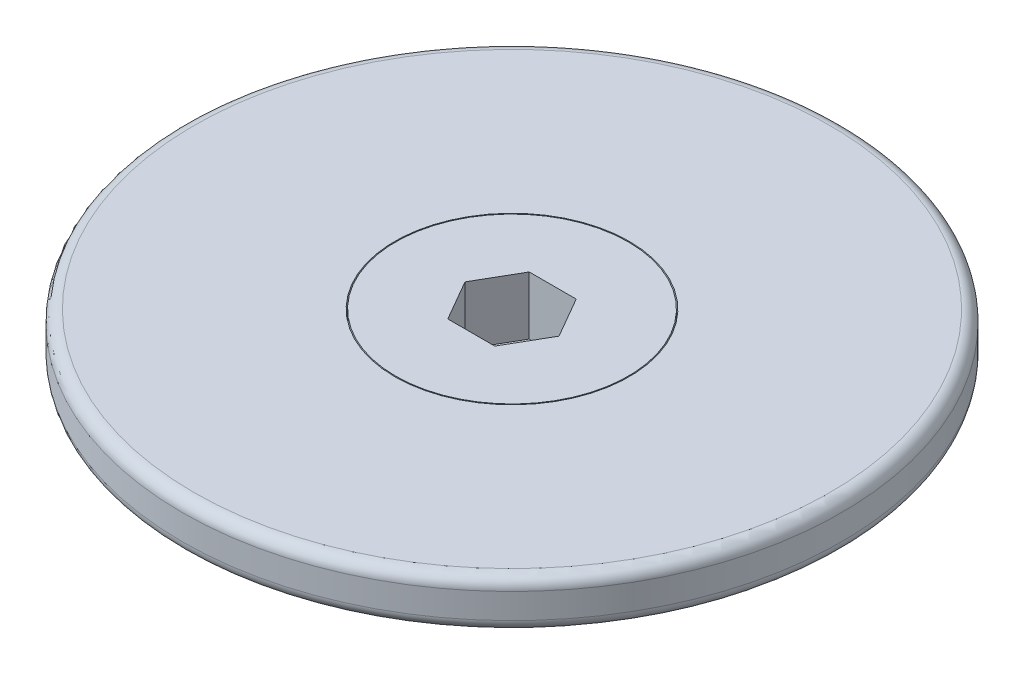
from build123d import *

# Parameters (mm, degrees)
SKETCH1_R           = 17
SKETCH1_R_2         = 6.05
BOSS_EXTRUDE1_DEPTH = 2.5
SKETCH2_R           = 6
BOSS_EXTRUDE2_DEPTH = 4
CUT_EXTRUDE1_DEPTH  = 3
FILLET1_R           = 0.6


with BuildPart() as part:
    # Sketch1 → Boss-Extrude1 (new body)
    with BuildSketch(Plane(origin=(0, 0, 0), x_dir=(1, 0, 0), z_dir=(0, 1, 0))):
        with Locations(Location((0, 0, 0), (0, 0, 270))):
            Circle(SKETCH1_R)
        with Locations(Location((0, 0, 0), (0, 0, 270))):
            Circle(SKETCH1_R_2, mode=Mode.SUBTRACT)
    extrude(amount=BOSS_EXTRUDE1_DEPTH)

    # Fillet1
    fillet1_edges = [part.edges().sort_by_distance(p)[0] for p in [
        (0, 0, -17),
        (0, 2.5, -17),
    ]]
    fillet(fillet1_edges, radius=FILLET1_R)


with BuildPart() as body_2:
    # Sketch2 → Boss-Extrude2 (new body)
    with BuildSketch(Plane(origin=(0, 2.5, 0), x_dir=(1, 0, 0), z_dir=(0, 1, 0))):
        with Locations(Location((0, 0, 0), (0, 0, 270))):
            Circle(SKETCH2_R)
    extrude(amount=-BOSS_EXTRUDE2_DEPTH)

    # Sketch3 → Cut-Extrude1 (cut)
    with BuildSketch(Plane(origin=(0, 2.5, 0), x_dir=(1, 0, 0), z_dir=(0, 1, 0))):
        Polygon((1.212435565, -2.1), (2.424871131, 0), (1.212435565, 2.1), (-1.212435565, 2.1), (-2.424871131, 0), (-1.212435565, -2.1), align=None)
    extrude(amount=-CUT_EXTRUDE1_DEPTH, mode=Mode.SUBTRACT)


solid = Compound([part.part, body_2.part])
